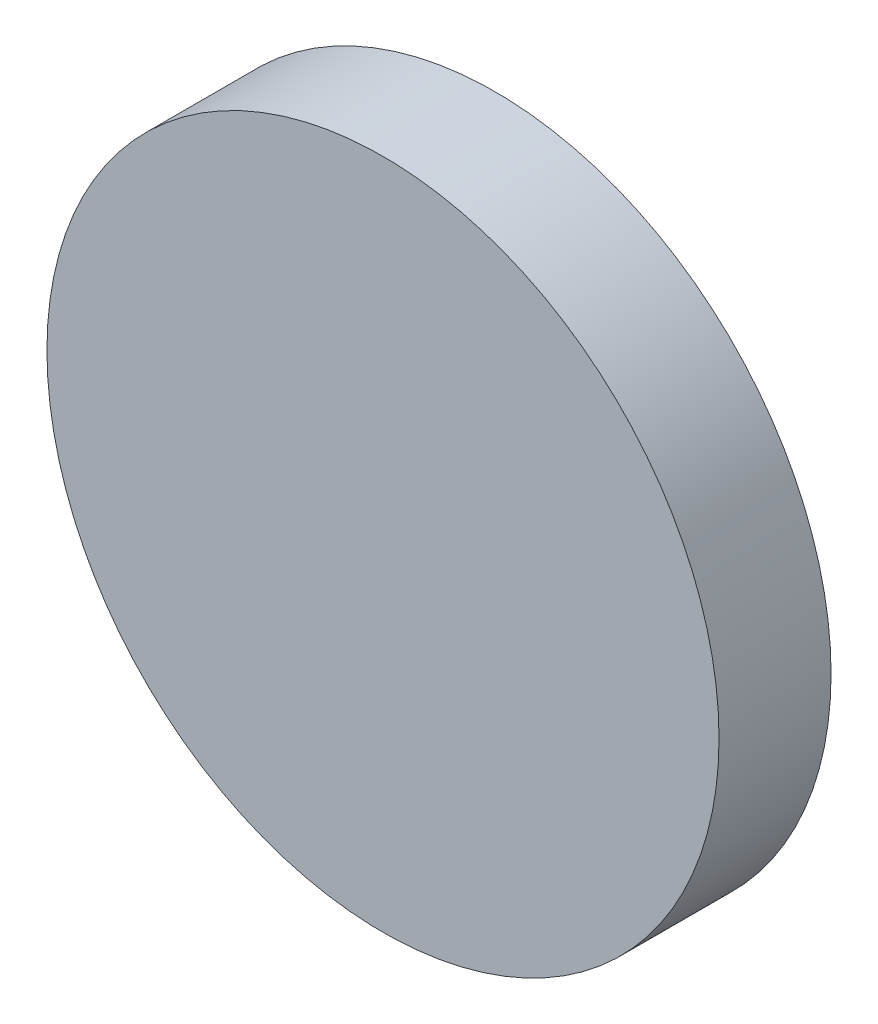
ISO-10303-21;
HEADER;
FILE_DESCRIPTION(('STEP AP214'),'2;1');
FILE_NAME('part.step','',(''),(''),'','','');
FILE_SCHEMA(('AUTOMOTIVE_DESIGN { 1 0 10303 214 1 1 1 1 }'));
ENDSEC;
DATA;
#1=APPLICATION_CONTEXT('core data for automotive mechanical design processes');
#2=APPLICATION_PROTOCOL_DEFINITION('international standard','automotive_design',2000,#1);
#3=PRODUCT_CONTEXT('',#1,'mechanical');
#4=PRODUCT('Part','Part','',(#3));
#5=PRODUCT_RELATED_PRODUCT_CATEGORY('part','',(#4));
#6=PRODUCT_DEFINITION_FORMATION('','',#4);
#7=PRODUCT_DEFINITION_CONTEXT('part definition',#1,'design');
#8=PRODUCT_DEFINITION('design','',#6,#7);
#9=PRODUCT_DEFINITION_SHAPE('','',#8);
#10=(LENGTH_UNIT() NAMED_UNIT(*) SI_UNIT(.MILLI.,.METRE.));
#11=(NAMED_UNIT(*) PLANE_ANGLE_UNIT() SI_UNIT($,.RADIAN.));
#12=(NAMED_UNIT(*) SI_UNIT($,.STERADIAN.) SOLID_ANGLE_UNIT());
#13=UNCERTAINTY_MEASURE_WITH_UNIT(LENGTH_MEASURE(1.E-05),#10,'distance_accuracy_value','');
#14=(GEOMETRIC_REPRESENTATION_CONTEXT(3) GLOBAL_UNCERTAINTY_ASSIGNED_CONTEXT((#13)) GLOBAL_UNIT_ASSIGNED_CONTEXT((#10,
#11,#12)) REPRESENTATION_CONTEXT('',''));
#15=CARTESIAN_POINT('',(0.,0.,0.));
#16=DIRECTION('',(0.,0.,1.));
#17=DIRECTION('',(1.,0.,0.));
#18=AXIS2_PLACEMENT_3D('',#15,#16,#17);
#19=CARTESIAN_POINT('',(0.,0.,4.));
#20=DIRECTION('',(0.,0.,-1.));
#21=DIRECTION('',(-1.,0.,0.));
#22=AXIS2_PLACEMENT_3D('',#19,#20,#21);
#23=CYLINDRICAL_SURFACE('',#22,12.);
#24=CARTESIAN_POINT('',(0.,0.,4.));
#25=DIRECTION('',(0.,0.,1.));
#26=DIRECTION('',(1.,0.,0.));
#27=AXIS2_PLACEMENT_3D('',#24,#25,#26);
#28=CIRCLE('',#27,12.);
#29=CARTESIAN_POINT('',(12.,0.,4.));
#30=VERTEX_POINT('',#29);
#31=EDGE_CURVE('E11',#30,#30,#28,.T.);
#32=ORIENTED_EDGE('',*,*,#31,.F.);
#33=EDGE_LOOP('',(#32));
#34=FACE_BOUND('',#33,.T.);
#35=CARTESIAN_POINT('',(0.,0.,0.));
#36=DIRECTION('',(0.,0.,1.));
#37=DIRECTION('',(1.,0.,0.));
#38=AXIS2_PLACEMENT_3D('',#35,#36,#37);
#39=CIRCLE('',#38,12.);
#40=CARTESIAN_POINT('',(12.,0.,0.));
#41=VERTEX_POINT('',#40);
#42=EDGE_CURVE('E37',#41,#41,#39,.T.);
#43=ORIENTED_EDGE('',*,*,#42,.T.);
#44=EDGE_LOOP('',(#43));
#45=FACE_BOUND('',#44,.T.);
#46=ADVANCED_FACE('F29',(#34,#45),#23,.T.);
#47=CARTESIAN_POINT('',(0.,0.,4.));
#48=DIRECTION('',(0.,0.,1.));
#49=DIRECTION('',(1.,0.,0.));
#50=AXIS2_PLACEMENT_3D('',#47,#48,#49);
#51=PLANE('',#50);
#52=ORIENTED_EDGE('',*,*,#31,.T.);
#53=EDGE_LOOP('',(#52));
#54=FACE_BOUND('',#53,.T.);
#55=ADVANCED_FACE('F46',(#54),#51,.T.);
#56=CARTESIAN_POINT('',(0.,0.,0.));
#57=DIRECTION('',(0.,0.,1.));
#58=DIRECTION('',(1.,0.,0.));
#59=AXIS2_PLACEMENT_3D('',#56,#57,#58);
#60=PLANE('',#59);
#61=ORIENTED_EDGE('',*,*,#42,.F.);
#62=EDGE_LOOP('',(#61));
#63=FACE_BOUND('',#62,.T.);
#64=ADVANCED_FACE('F44',(#63),#60,.F.);
#65=CLOSED_SHELL('',(#46,#55,#64));
#66=MANIFOLD_SOLID_BREP('B2',#65);
#67=ADVANCED_BREP_SHAPE_REPRESENTATION('',(#18,#66),#14);
#68=SHAPE_DEFINITION_REPRESENTATION(#9,#67);
ENDSEC;
END-ISO-10303-21;
